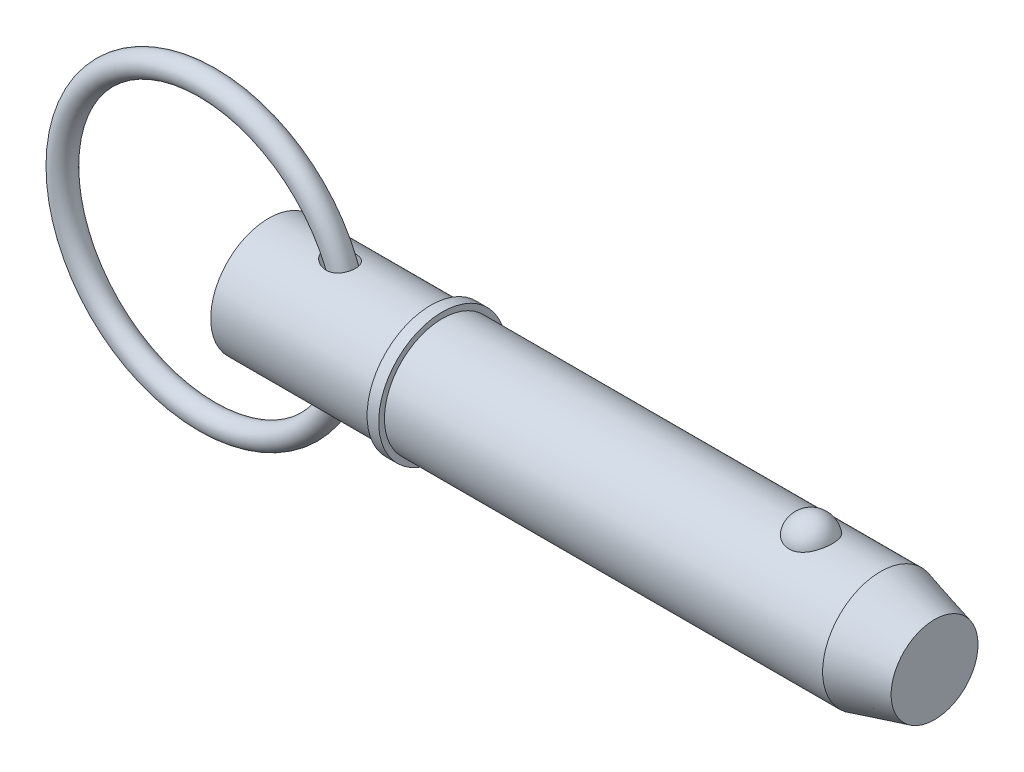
ISO-10303-21;
HEADER;
FILE_DESCRIPTION(('STEP AP214'),'2;1');
FILE_NAME('part.step','',(''),(''),'','','');
FILE_SCHEMA(('AUTOMOTIVE_DESIGN { 1 0 10303 214 1 1 1 1 }'));
ENDSEC;
DATA;
#1=APPLICATION_CONTEXT('core data for automotive mechanical design processes');
#2=APPLICATION_PROTOCOL_DEFINITION('international standard','automotive_design',2000,#1);
#3=PRODUCT_CONTEXT('',#1,'mechanical');
#4=PRODUCT('Part','Part','',(#3));
#5=PRODUCT_RELATED_PRODUCT_CATEGORY('part','',(#4));
#6=PRODUCT_DEFINITION_FORMATION('','',#4);
#7=PRODUCT_DEFINITION_CONTEXT('part definition',#1,'design');
#8=PRODUCT_DEFINITION('design','',#6,#7);
#9=PRODUCT_DEFINITION_SHAPE('','',#8);
#10=(LENGTH_UNIT() NAMED_UNIT(*) SI_UNIT(.MILLI.,.METRE.));
#11=(NAMED_UNIT(*) PLANE_ANGLE_UNIT() SI_UNIT($,.RADIAN.));
#12=(NAMED_UNIT(*) SI_UNIT($,.STERADIAN.) SOLID_ANGLE_UNIT());
#13=UNCERTAINTY_MEASURE_WITH_UNIT(LENGTH_MEASURE(1.E-05),#10,'distance_accuracy_value','');
#14=(GEOMETRIC_REPRESENTATION_CONTEXT(3) GLOBAL_UNCERTAINTY_ASSIGNED_CONTEXT((#13)) GLOBAL_UNIT_ASSIGNED_CONTEXT((#10,
#11,#12)) REPRESENTATION_CONTEXT('',''));
#15=CARTESIAN_POINT('',(0.,0.,0.));
#16=DIRECTION('',(0.,0.,1.));
#17=DIRECTION('',(1.,0.,0.));
#18=AXIS2_PLACEMENT_3D('',#15,#16,#17);
#19=CARTESIAN_POINT('',(-13.4840686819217,0.,0.));
#20=DIRECTION('',(0.,0.,1.));
#21=DIRECTION('',(1.,0.,0.));
#22=AXIS2_PLACEMENT_3D('',#19,#20,#21);
#23=TOROIDAL_SURFACE('',#22,31.75,2.54);
#24=CARTESIAN_POINT('',(20.8059313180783,0.,0.));
#25=VERTEX_POINT('',#24);
#26=VERTEX_LOOP('',#25);
#27=FACE_BOUND('',#26,.T.);
#28=ADVANCED_FACE('P0_F12',(#27),#23,.T.);
#29=CLOSED_SHELL('',(#28));
#30=MANIFOLD_SOLID_BREP('P0_B1',#29);
#31=CARTESIAN_POINT('',(0.,0.,0.));
#32=DIRECTION('',(1.,0.,0.));
#33=DIRECTION('',(0.,0.,-1.));
#34=AXIS2_PLACEMENT_3D('',#31,#32,#33);
#35=CYLINDRICAL_SURFACE('',#34,12.7);
#36=CARTESIAN_POINT('',(13.092900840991,12.5230976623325,-2.11234992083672));
#37=CARTESIAN_POINT('',(13.2535855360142,12.4976398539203,-2.26328363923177));
#38=CARTESIAN_POINT('',(13.4280602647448,12.4718592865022,-2.39955782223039));
#39=CARTESIAN_POINT('',(13.7976341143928,12.4229301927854,-2.64122157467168));
#40=CARTESIAN_POINT('',(13.9927568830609,12.3997847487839,-2.7465751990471));
#41=CARTESIAN_POINT('',(14.397672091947,12.3590534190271,-2.92439761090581));
#42=CARTESIAN_POINT('',(14.6074445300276,12.3414601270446,-2.99691026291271));
#43=CARTESIAN_POINT('',(15.0366557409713,12.3142893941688,-3.10669649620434));
#44=CARTESIAN_POINT('',(15.2560902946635,12.3047084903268,-3.14398530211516));
#45=CARTESIAN_POINT('',(15.5877843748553,12.2976819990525,-3.17128282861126));
#46=CARTESIAN_POINT('',(15.6989364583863,12.2965677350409,-3.17559470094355));
#47=CARTESIAN_POINT('',(15.9211629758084,12.2969101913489,-3.17427486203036));
#48=CARTESIAN_POINT('',(16.0322374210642,12.2983656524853,-3.16864802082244));
#49=CARTESIAN_POINT('',(16.2532861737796,12.3038832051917,-3.14715368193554));
#50=CARTESIAN_POINT('',(16.363260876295,12.3079443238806,-3.13129000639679));
#51=CARTESIAN_POINT('',(16.5810669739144,12.3185954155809,-3.08912320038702));
#52=CARTESIAN_POINT('',(16.6888986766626,12.3251850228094,-3.06282157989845));
#53=CARTESIAN_POINT('',(16.8894247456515,12.3398294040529,-3.00323791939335));
#54=CARTESIAN_POINT('',(16.9824664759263,12.3476389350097,-2.97106098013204));
#55=CARTESIAN_POINT('',(17.1651267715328,12.3648759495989,-2.89848824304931));
#56=CARTESIAN_POINT('',(17.2547457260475,12.3743032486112,-2.85809338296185));
#57=CARTESIAN_POINT('',(17.4297224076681,12.3944822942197,-2.76927391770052));
#58=CARTESIAN_POINT('',(17.5150817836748,12.40523352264,-2.72085245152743));
#59=CARTESIAN_POINT('',(17.6807665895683,12.4277046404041,-2.61629867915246));
#60=CARTESIAN_POINT('',(17.7610923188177,12.4394244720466,-2.56016683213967));
#61=CARTESIAN_POINT('',(17.9797287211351,12.4733252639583,-2.39133767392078));
#62=CARTESIAN_POINT('',(18.1114611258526,12.4961902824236,-2.27005507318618));
#63=CARTESIAN_POINT('',(18.3518677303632,12.5412050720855,-2.00648954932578));
#64=CARTESIAN_POINT('',(18.4605454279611,12.5633549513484,-1.86420981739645));
#65=CARTESIAN_POINT('',(18.6498843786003,12.6039384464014,-1.5661481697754));
#66=CARTESIAN_POINT('',(18.7311185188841,12.622444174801,-1.41073996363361));
#67=CARTESIAN_POINT('',(18.8669149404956,12.6543302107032,-1.08819514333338));
#68=CARTESIAN_POINT('',(18.921477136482,12.6677105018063,-0.921058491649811));
#69=CARTESIAN_POINT('',(19.0028875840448,12.6879542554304,-0.57902988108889));
#70=CARTESIAN_POINT('',(19.0296164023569,12.6947896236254,-0.40410783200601));
#71=CARTESIAN_POINT('',(19.0543673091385,12.7011128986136,-0.0521104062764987));
#72=CARTESIAN_POINT('',(19.0523885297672,12.7006005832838,0.124965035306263));
#73=CARTESIAN_POINT('',(19.019700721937,12.692266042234,0.476969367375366));
#74=CARTESIAN_POINT('',(18.9888798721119,12.6844153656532,0.651887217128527));
#75=CARTESIAN_POINT('',(18.8990221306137,12.6622099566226,0.99389064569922));
#76=CARTESIAN_POINT('',(18.839985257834,12.6478552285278,1.16097622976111));
#77=CARTESIAN_POINT('',(18.6951419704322,12.6142309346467,1.48231767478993));
#78=CARTESIAN_POINT('',(18.6093706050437,12.5949678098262,1.63659000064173));
#79=CARTESIAN_POINT('',(18.4131352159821,12.5536490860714,1.92810749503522));
#80=CARTESIAN_POINT('',(18.3026732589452,12.5315937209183,2.06535408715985));
#81=CARTESIAN_POINT('',(18.060669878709,12.4872833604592,2.31822774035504));
#82=CARTESIAN_POINT('',(17.9292520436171,12.4650302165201,2.43397343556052));
#83=CARTESIAN_POINT('',(17.6485957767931,12.4226514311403,2.64178289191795));
#84=CARTESIAN_POINT('',(17.4993587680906,12.4025256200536,2.73384854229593));
#85=CARTESIAN_POINT('',(17.1869531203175,12.3664726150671,2.8925825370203));
#86=CARTESIAN_POINT('',(17.0237450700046,12.3505578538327,2.95917592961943));
#87=CARTESIAN_POINT('',(16.6884731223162,12.3245177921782,3.06582547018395));
#88=CARTESIAN_POINT('',(16.516407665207,12.3143935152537,3.10587692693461));
#89=CARTESIAN_POINT('',(16.1604213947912,12.3003788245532,3.16093927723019));
#90=CARTESIAN_POINT('',(15.9763106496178,12.2967791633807,3.17478342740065));
#91=CARTESIAN_POINT('',(15.6080973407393,12.2966663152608,3.1752118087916));
#92=CARTESIAN_POINT('',(15.4239948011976,12.3001555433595,3.16178674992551));
#93=CARTESIAN_POINT('',(15.0417156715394,12.3141744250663,3.10676725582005));
#94=CARTESIAN_POINT('',(14.8439465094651,12.3253658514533,3.06251977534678));
#95=CARTESIAN_POINT('',(14.4574652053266,12.3538942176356,2.94531863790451));
#96=CARTESIAN_POINT('',(14.2687614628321,12.3712367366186,2.87233891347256));
#97=CARTESIAN_POINT('',(13.8856104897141,12.4121323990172,2.69045747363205));
#98=CARTESIAN_POINT('',(13.6926012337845,12.4361434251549,2.57861276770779));
#99=CARTESIAN_POINT('',(13.328588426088,12.4862632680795,2.32379935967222));
#100=CARTESIAN_POINT('',(13.1575718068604,12.5123708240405,2.18084927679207));
#101=CARTESIAN_POINT('',(12.8776146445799,12.5579467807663,1.89840233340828));
#102=CARTESIAN_POINT('',(12.7631663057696,12.5776642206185,1.76440341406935));
#103=CARTESIAN_POINT('',(12.5574911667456,12.6143643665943,1.47931295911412));
#104=CARTESIAN_POINT('',(12.4662309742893,12.6313509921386,1.32824646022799));
#105=CARTESIAN_POINT('',(12.3240650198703,12.6583901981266,1.03598403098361));
#106=CARTESIAN_POINT('',(12.2691183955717,12.6691064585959,0.89682285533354));
#107=CARTESIAN_POINT('',(12.1828741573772,12.6860954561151,0.611068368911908));
#108=CARTESIAN_POINT('',(12.1515620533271,12.6923709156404,0.464479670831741));
#109=CARTESIAN_POINT('',(12.1147168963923,12.6997676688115,0.167420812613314));
#110=CARTESIAN_POINT('',(12.109270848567,12.7008715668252,0.0169392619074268));
#111=CARTESIAN_POINT('',(12.1248234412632,12.6977391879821,-0.282592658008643));
#112=CARTESIAN_POINT('',(12.1458245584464,12.6935024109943,-0.431642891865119));
#113=CARTESIAN_POINT('',(12.210908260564,12.6805581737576,-0.716008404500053));
#114=CARTESIAN_POINT('',(12.2537133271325,12.6720986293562,-0.851633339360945));
#115=CARTESIAN_POINT('',(12.3591295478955,12.6516826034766,-1.11460776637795));
#116=CARTESIAN_POINT('',(12.4217455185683,12.6397252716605,-1.24195523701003));
#117=CARTESIAN_POINT('',(12.5735635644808,12.61152213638,-1.50300095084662));
#118=CARTESIAN_POINT('',(12.6652159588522,12.5949150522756,-1.63522875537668));
#119=CARTESIAN_POINT('',(12.8664347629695,12.5599626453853,-1.88501670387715));
#120=CARTESIAN_POINT('',(12.9760196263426,12.541615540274,-2.00256151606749));
#121=CARTESIAN_POINT('',(13.092900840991,12.5230976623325,-2.11234992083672));
#122=B_SPLINE_CURVE_WITH_KNOTS('',3,(#36,#37,#38,#39,#40,#41,#42,#43,#44,#45,#46,#47,#48,#49,
#50,#51,#52,#53,#54,#55,#56,#57,#58,#59,#60,#61,#62,#63,#64,#65,#66,#67,#68,#69,#70,#71,#72,#73,
#74,#75,#76,#77,#78,#79,#80,#81,#82,#83,#84,#85,#86,#87,#88,#89,#90,#91,#92,#93,#94,#95,#96,#97,
#98,#99,#100,#101,#102,#103,#104,#105,#106,#107,#108,#109,#110,#111,#112,#113,#114,#115,#116,
#117,#118,#119,#120,#121),.UNSPECIFIED.,.T.,.F.,(4,2,2,2,2,2,2,2,2,2,2,2,2,2,2,2,2,2,2,2,2,2,2,
2,2,2,2,2,2,2,2,2,2,2,2,2,2,2,2,2,2,2,4),(0.,0.665132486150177,1.33103515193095,
1.99604575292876,2.66076878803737,2.99410229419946,3.32727250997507,3.66031840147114,
3.99331613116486,4.28918991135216,4.58502994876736,4.88075456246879,5.17646157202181,
5.71510826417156,6.25367317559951,6.78017774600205,7.30668400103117,7.83544030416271,
8.36421259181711,8.89504347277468,9.42587399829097,9.95601150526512,10.4861046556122,
11.0131799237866,11.54021312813,12.0687854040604,12.597451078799,13.1491450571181,
13.7010270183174,14.3074556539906,14.914435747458,15.5844380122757,16.2540403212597,
16.7839879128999,17.3131679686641,17.7612578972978,18.2090728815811,18.658393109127,
19.1077554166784,19.5333866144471,19.959121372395,20.4424347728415,20.9262486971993),.UNSPECIFIED.);
#123=CARTESIAN_POINT('',(13.092900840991,12.5230976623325,-2.11234992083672));
#124=VERTEX_POINT('',#123);
#125=EDGE_CURVE('P1_E42',#124,#124,#122,.T.);
#126=ORIENTED_EDGE('',*,*,#125,.T.);
#127=EDGE_LOOP('',(#126));
#128=FACE_BOUND('',#127,.T.);
#129=CARTESIAN_POINT('',(0.,0.,0.));
#130=DIRECTION('',(1.,0.,0.));
#131=DIRECTION('',(0.,0.,-1.));
#132=AXIS2_PLACEMENT_3D('',#129,#130,#131);
#133=CIRCLE('',#132,12.7);
#134=CARTESIAN_POINT('',(0.,0.,-12.7));
#135=VERTEX_POINT('',#134);
#136=EDGE_CURVE('P1_E9',#135,#135,#133,.T.);
#137=ORIENTED_EDGE('',*,*,#136,.T.);
#138=EDGE_LOOP('',(#137));
#139=FACE_BOUND('',#138,.T.);
#140=CARTESIAN_POINT('',(35.56,0.,0.));
#141=DIRECTION('',(1.,0.,0.));
#142=DIRECTION('',(0.,0.,-1.));
#143=AXIS2_PLACEMENT_3D('',#140,#141,#142);
#144=CIRCLE('',#143,12.7);
#145=CARTESIAN_POINT('',(35.56,0.,-12.7));
#146=VERTEX_POINT('',#145);
#147=EDGE_CURVE('P1_E25',#146,#146,#144,.T.);
#148=ORIENTED_EDGE('',*,*,#147,.F.);
#149=EDGE_LOOP('',(#148));
#150=FACE_BOUND('',#149,.T.);
#151=CARTESIAN_POINT('',(13.092900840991,-12.5230976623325,-2.11234992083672));
#152=CARTESIAN_POINT('',(12.9659872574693,-12.5432050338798,-1.99314161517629));
#153=CARTESIAN_POINT('',(12.847667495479,-12.5631124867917,-1.86478966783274));
#154=CARTESIAN_POINT('',(12.6324721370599,-12.6007427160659,-1.59069749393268));
#155=CARTESIAN_POINT('',(12.5355833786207,-12.6184668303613,-1.444968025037));
#156=CARTESIAN_POINT('',(12.4099071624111,-12.642034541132,-1.21450950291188));
#157=CARTESIAN_POINT('',(12.3711427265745,-12.6494175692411,-1.13527163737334));
#158=CARTESIAN_POINT('',(12.3010994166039,-12.6628962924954,-0.973464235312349));
#159=CARTESIAN_POINT('',(12.2698164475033,-12.6689926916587,-0.890896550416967));
#160=CARTESIAN_POINT('',(12.2153933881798,-12.6796767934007,-0.72309085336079));
#161=CARTESIAN_POINT('',(12.192246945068,-12.6842656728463,-0.637854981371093));
#162=CARTESIAN_POINT('',(12.154603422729,-12.6917620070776,-0.465421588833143));
#163=CARTESIAN_POINT('',(12.1401047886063,-12.69466976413,-0.378224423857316));
#164=CARTESIAN_POINT('',(12.1214471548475,-12.6984180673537,-0.214417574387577));
#165=CARTESIAN_POINT('',(12.1161713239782,-12.699481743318,-0.13793855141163));
#166=CARTESIAN_POINT('',(12.1124989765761,-12.7002217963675,0.0152189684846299));
#167=CARTESIAN_POINT('',(12.1141046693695,-12.6998977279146,0.0918975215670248));
#168=CARTESIAN_POINT('',(12.1241695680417,-12.6978712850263,0.244746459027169));
#169=CARTESIAN_POINT('',(12.132625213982,-12.6961696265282,0.320917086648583));
#170=CARTESIAN_POINT('',(12.1562110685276,-12.6914452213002,0.472185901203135));
#171=CARTESIAN_POINT('',(12.1713438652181,-12.6884219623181,0.547283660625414));
#172=CARTESIAN_POINT('',(12.223731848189,-12.6780227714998,0.759415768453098));
#173=CARTESIAN_POINT('',(12.268839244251,-12.6691353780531,0.894507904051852));
#174=CARTESIAN_POINT('',(12.3786059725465,-12.6479567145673,1.1560647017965));
#175=CARTESIAN_POINT('',(12.4432700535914,-12.6356646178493,1.28252725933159));
#176=CARTESIAN_POINT('',(12.5971341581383,-12.607236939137,1.5381272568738));
#177=CARTESIAN_POINT('',(12.6882234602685,-12.5908303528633,1.66609325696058));
#178=CARTESIAN_POINT('',(12.887209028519,-12.5564642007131,1.90792082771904));
#179=CARTESIAN_POINT('',(12.995115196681,-12.5385037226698,2.02177401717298));
#180=CARTESIAN_POINT('',(13.2471335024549,-12.4987806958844,2.25547266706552));
#181=CARTESIAN_POINT('',(13.3941979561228,-12.4769622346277,2.3721269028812));
#182=CARTESIAN_POINT('',(13.7036983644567,-12.4349587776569,2.58329351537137));
#183=CARTESIAN_POINT('',(13.8661464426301,-12.4147750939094,2.67778822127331));
#184=CARTESIAN_POINT('',(14.2306024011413,-12.3748157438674,2.85722657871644));
#185=CARTESIAN_POINT('',(14.4347220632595,-12.3556533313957,2.93804226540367));
#186=CARTESIAN_POINT('',(14.8540416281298,-12.3245430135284,3.06594877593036));
#187=CARTESIAN_POINT('',(15.0692453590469,-12.3125976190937,3.11302786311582));
#188=CARTESIAN_POINT('',(15.3981213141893,-12.3014943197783,3.15648626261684));
#189=CARTESIAN_POINT('',(15.5100235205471,-12.298940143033,3.16639841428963));
#190=CARTESIAN_POINT('',(15.7342812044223,-12.2963942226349,3.17627668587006));
#191=CARTESIAN_POINT('',(15.8466364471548,-12.2964012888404,3.17624742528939));
#192=CARTESIAN_POINT('',(16.0707903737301,-12.2990694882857,3.16589868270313));
#193=CARTESIAN_POINT('',(16.1825892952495,-12.3017293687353,3.1555840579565));
#194=CARTESIAN_POINT('',(16.4046123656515,-12.3096862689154,3.12440163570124));
#195=CARTESIAN_POINT('',(16.514836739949,-12.314982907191,3.10353536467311));
#196=CARTESIAN_POINT('',(16.7211934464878,-12.3273933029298,3.05384263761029));
#197=CARTESIAN_POINT('',(16.8175961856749,-12.3342598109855,3.0260738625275));
#198=CARTESIAN_POINT('',(17.0073515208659,-12.3498131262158,2.96195947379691));
#199=CARTESIAN_POINT('',(17.100704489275,-12.3584997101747,2.92561491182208));
#200=CARTESIAN_POINT('',(17.2834584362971,-12.3774243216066,2.84448580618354));
#201=CARTESIAN_POINT('',(17.3728610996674,-12.3876616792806,2.79970490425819));
#202=CARTESIAN_POINT('',(17.5469061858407,-12.409352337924,2.701939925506));
#203=CARTESIAN_POINT('',(17.6315489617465,-12.4208055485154,2.64895645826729));
#204=CARTESIAN_POINT('',(17.7872886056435,-12.4433734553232,2.54070972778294));
#205=CARTESIAN_POINT('',(17.8589017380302,-12.4544123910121,2.4861716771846));
#206=CARTESIAN_POINT('',(17.9970802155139,-12.4768404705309,2.37105291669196));
#207=CARTESIAN_POINT('',(18.063643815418,-12.4882297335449,2.31047013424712));
#208=CARTESIAN_POINT('',(18.1911677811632,-12.5110137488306,2.18372894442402));
#209=CARTESIAN_POINT('',(18.2521311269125,-12.5224084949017,2.11757353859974));
#210=CARTESIAN_POINT('',(18.3680676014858,-12.5448751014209,1.98014449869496));
#211=CARTESIAN_POINT('',(18.4230385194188,-12.5559468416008,1.90886899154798));
#212=CARTESIAN_POINT('',(18.5752306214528,-12.5875288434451,1.6925769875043));
#213=CARTESIAN_POINT('',(18.6637018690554,-12.6071482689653,1.54111740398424));
#214=CARTESIAN_POINT('',(18.8143485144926,-12.6417556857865,1.225260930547));
#215=CARTESIAN_POINT('',(18.876524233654,-12.6567437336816,1.06086419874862));
#216=CARTESIAN_POINT('',(18.9733884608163,-12.6805238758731,0.723195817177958));
#217=CARTESIAN_POINT('',(19.0079967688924,-12.6892978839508,0.549899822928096));
#218=CARTESIAN_POINT('',(19.0486500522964,-12.6996362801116,0.199781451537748));
#219=CARTESIAN_POINT('',(19.054694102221,-12.7012004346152,0.0229589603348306));
#220=CARTESIAN_POINT('',(19.0380549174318,-12.6969431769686,-0.330044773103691));
#221=CARTESIAN_POINT('',(19.0152419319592,-12.6910884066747,-0.506219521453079));
#222=CARTESIAN_POINT('',(18.9411599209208,-12.672565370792,-0.852112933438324));
#223=CARTESIAN_POINT('',(18.8898907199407,-12.659897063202,-1.0218315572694));
#224=CARTESIAN_POINT('',(18.7600888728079,-12.6291327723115,-1.34987035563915));
#225=CARTESIAN_POINT('',(18.6815715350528,-12.6110398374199,-1.50819687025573));
#226=CARTESIAN_POINT('',(18.4991526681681,-12.5714188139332,-1.808997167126));
#227=CARTESIAN_POINT('',(18.3952529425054,-12.5498909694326,-1.95147207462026));
#228=CARTESIAN_POINT('',(18.1653806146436,-12.5059234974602,-2.21580059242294));
#229=CARTESIAN_POINT('',(18.0395297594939,-12.4834893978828,-2.33776101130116));
#230=CARTESIAN_POINT('',(17.7688701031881,-12.4400863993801,-2.55870399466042));
#231=CARTESIAN_POINT('',(17.624063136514,-12.4191173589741,-2.65768878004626));
#232=CARTESIAN_POINT('',(17.3196803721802,-12.380896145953,-2.8304192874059));
#233=CARTESIAN_POINT('',(17.1601036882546,-12.3636441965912,-2.90416349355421));
#234=CARTESIAN_POINT('',(16.8308162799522,-12.3345597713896,-3.02531546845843));
#235=CARTESIAN_POINT('',(16.6611041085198,-12.322728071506,-3.07271946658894));
#236=CARTESIAN_POINT('',(16.3099674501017,-12.3051318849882,-3.14246490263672));
#237=CARTESIAN_POINT('',(16.1283412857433,-12.2996014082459,-3.16384159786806));
#238=CARTESIAN_POINT('',(15.7639014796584,-12.2955807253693,-3.17942379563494));
#239=CARTESIAN_POINT('',(15.5810875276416,-12.2970924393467,-3.17362188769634));
#240=CARTESIAN_POINT('',(15.20154276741,-12.307074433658,-3.13470416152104));
#241=CARTESIAN_POINT('',(15.0050835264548,-12.316173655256,-3.09911848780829));
#242=CARTESIAN_POINT('',(14.6197996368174,-12.3407987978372,-2.99954607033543));
#243=CARTESIAN_POINT('',(14.4309834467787,-12.3563316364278,-2.93552875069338));
#244=CARTESIAN_POINT('',(14.0353751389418,-12.3949378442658,-2.76840280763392));
#245=CARTESIAN_POINT('',(13.8306109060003,-12.4188242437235,-2.66064798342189));
#246=CARTESIAN_POINT('',(13.4432099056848,-12.4696241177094,-2.4113475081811));
#247=CARTESIAN_POINT('',(13.2605568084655,-12.4965353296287,-2.26982702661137));
#248=CARTESIAN_POINT('',(13.092900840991,-12.5230976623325,-2.11234992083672));
#249=B_SPLINE_CURVE_WITH_KNOTS('',3,(#151,#152,#153,#154,#155,#156,#157,#158,#159,#160,#161,
#162,#163,#164,#165,#166,#167,#168,#169,#170,#171,#172,#173,#174,#175,#176,#177,#178,#179,#180,
#181,#182,#183,#184,#185,#186,#187,#188,#189,#190,#191,#192,#193,#194,#195,#196,#197,#198,#199,
#200,#201,#202,#203,#204,#205,#206,#207,#208,#209,#210,#211,#212,#213,#214,#215,#216,#217,#218,
#219,#220,#221,#222,#223,#224,#225,#226,#227,#228,#229,#230,#231,#232,#233,#234,#235,#236,#237,
#238,#239,#240,#241,#242,#243,#244,#245,#246,#247,#248),.UNSPECIFIED.,.T.,.F.,(4,2,2,2,2,2,2,2,
2,2,2,2,2,2,2,2,2,2,2,2,2,2,2,2,2,2,2,2,2,2,2,2,2,2,2,2,2,2,2,2,2,2,2,2,2,2,2,2,4),(0.,
0.525289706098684,1.05025590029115,1.31549608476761,1.58059075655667,1.84547798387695,
2.11031756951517,2.34000998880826,2.56977615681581,2.79942299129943,3.0291589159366,
3.45531787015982,3.8815803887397,4.35362362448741,4.82594586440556,5.39074449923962,
5.95599200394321,6.61421946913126,7.27267581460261,7.60939383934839,7.94595540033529,
8.2823580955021,8.61871213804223,8.91997243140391,9.22119579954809,9.52228943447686,
9.82336070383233,10.0950952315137,10.3669232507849,10.6386057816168,10.9103882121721,
11.4371688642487,11.9639430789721,12.4922442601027,13.0205625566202,13.5512648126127,
14.0819703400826,14.6123781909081,15.1427483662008,15.6702654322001,16.1977314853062,
16.7252292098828,17.2528024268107,17.7993878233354,18.3461222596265,18.9432829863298,
19.5410874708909,20.2355241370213,20.9294447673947),.UNSPECIFIED.);
#250=CARTESIAN_POINT('',(13.092900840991,-12.5230976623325,-2.11234992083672));
#251=VERTEX_POINT('',#250);
#252=EDGE_CURVE('P1_E17',#251,#251,#249,.T.);
#253=ORIENTED_EDGE('',*,*,#252,.T.);
#254=EDGE_LOOP('',(#253));
#255=FACE_BOUND('',#254,.T.);
#256=ADVANCED_FACE('P1_F13',(#128,#139,#150,#255),#35,.T.);
#257=CARTESIAN_POINT('',(0.,0.,0.));
#258=DIRECTION('',(1.,0.,0.));
#259=DIRECTION('',(0.,0.,-1.));
#260=AXIS2_PLACEMENT_3D('',#257,#258,#259);
#261=CYLINDRICAL_SURFACE('',#260,12.7);
#262=CARTESIAN_POINT('',(134.200738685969,0.,0.));
#263=DIRECTION('',(1.,0.,0.));
#264=DIRECTION('',(0.,0.,-1.));
#265=AXIS2_PLACEMENT_3D('',#262,#263,#264);
#266=CIRCLE('',#265,12.7);
#267=CARTESIAN_POINT('',(134.200738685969,0.,-12.7));
#268=VERTEX_POINT('',#267);
#269=EDGE_CURVE('P1_E99',#268,#268,#266,.T.);
#270=ORIENTED_EDGE('',*,*,#269,.F.);
#271=EDGE_LOOP('',(#270));
#272=FACE_BOUND('',#271,.T.);
#273=CARTESIAN_POINT('',(38.1,0.,0.));
#274=DIRECTION('',(1.,0.,0.));
#275=DIRECTION('',(0.,0.,-1.));
#276=AXIS2_PLACEMENT_3D('',#273,#274,#275);
#277=CIRCLE('',#276,12.7);
#278=CARTESIAN_POINT('',(38.1,0.,-12.7));
#279=VERTEX_POINT('',#278);
#280=EDGE_CURVE('P1_E96',#279,#279,#277,.T.);
#281=ORIENTED_EDGE('',*,*,#280,.T.);
#282=EDGE_LOOP('',(#281));
#283=FACE_BOUND('',#282,.T.);
#284=CARTESIAN_POINT('',(118.960042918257,11.7500437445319,4.8193850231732));
#285=CARTESIAN_POINT('',(118.835088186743,11.7500430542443,4.81938571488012));
#286=CARTESIAN_POINT('',(118.710144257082,11.7520975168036,4.81438658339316));
#287=CARTESIAN_POINT('',(118.461142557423,11.760253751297,4.79442904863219));
#288=CARTESIAN_POINT('',(118.337085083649,11.7663568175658,4.77946746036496));
#289=CARTESIAN_POINT('',(118.090901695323,11.7824262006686,4.73971414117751));
#290=CARTESIAN_POINT('',(117.968774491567,11.7923898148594,4.71492928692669));
#291=CARTESIAN_POINT('',(117.727187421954,11.8158938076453,4.65571340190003));
#292=CARTESIAN_POINT('',(117.60772859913,11.8294355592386,4.62127866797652));
#293=CARTESIAN_POINT('',(117.372557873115,11.8596812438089,4.54309502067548));
#294=CARTESIAN_POINT('',(117.256839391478,11.8763792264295,4.4993636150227));
#295=CARTESIAN_POINT('',(117.029653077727,11.9124878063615,4.40287235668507));
#296=CARTESIAN_POINT('',(116.918186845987,11.9318994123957,4.35010914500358));
#297=CARTESIAN_POINT('',(116.591278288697,11.9934256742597,4.17881316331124));
#298=CARTESIAN_POINT('',(116.383127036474,12.038858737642,4.04720756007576));
#299=CARTESIAN_POINT('',(115.985850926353,12.1352173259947,3.74856446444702));
#300=CARTESIAN_POINT('',(115.797443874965,12.1862630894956,3.58061821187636));
#301=CARTESIAN_POINT('',(115.450521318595,12.2875163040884,3.21600758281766));
#302=CARTESIAN_POINT('',(115.292011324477,12.3377235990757,3.01933792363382));
#303=CARTESIAN_POINT('',(115.00168878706,12.434492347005,2.59291655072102));
#304=CARTESIAN_POINT('',(114.871376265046,12.4807925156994,2.36208286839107));
#305=CARTESIAN_POINT('',(114.649407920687,12.5623454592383,1.88070399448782));
#306=CARTESIAN_POINT('',(114.557755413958,12.5975972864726,1.63015711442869));
#307=CARTESIAN_POINT('',(114.414046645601,12.6538414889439,1.11298869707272));
#308=CARTESIAN_POINT('',(114.362499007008,12.6746503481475,0.846205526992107));
#309=CARTESIAN_POINT('',(114.301977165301,12.699153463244,0.307085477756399));
#310=CARTESIAN_POINT('',(114.293001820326,12.7028481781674,0.03474874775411));
#311=CARTESIAN_POINT('',(114.317731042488,12.6927785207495,-0.506073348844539));
#312=CARTESIAN_POINT('',(114.351189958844,12.6791146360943,-0.774571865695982));
#313=CARTESIAN_POINT('',(114.459687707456,12.635882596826,-1.3017024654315));
#314=CARTESIAN_POINT('',(114.53472729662,12.6063141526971,-1.56033436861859));
#315=CARTESIAN_POINT('',(114.72500006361,12.5342328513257,-2.06083899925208));
#316=CARTESIAN_POINT('',(114.840287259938,12.4917026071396,-2.3026886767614));
#317=CARTESIAN_POINT('',(115.108704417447,12.3981123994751,-2.76259600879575));
#318=CARTESIAN_POINT('',(115.261837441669,12.3470517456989,-2.98065173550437));
#319=CARTESIAN_POINT('',(115.603507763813,12.2416045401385,-3.38786328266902));
#320=CARTESIAN_POINT('',(115.792201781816,12.1872040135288,-3.57688418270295));
#321=CARTESIAN_POINT('',(116.200239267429,12.0814086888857,-3.91941073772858));
#322=CARTESIAN_POINT('',(116.419580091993,12.0300136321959,-4.07291945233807));
#323=CARTESIAN_POINT('',(116.878375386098,11.9373542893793,-4.33691289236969));
#324=CARTESIAN_POINT('',(117.117304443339,11.8958982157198,-4.44824125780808));
#325=CARTESIAN_POINT('',(117.61243761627,11.8268116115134,-4.62881985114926));
#326=CARTESIAN_POINT('',(117.868635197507,11.7991758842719,-4.69808589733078));
#327=CARTESIAN_POINT('',(118.377164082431,11.7622209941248,-4.78983181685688));
#328=CARTESIAN_POINT('',(118.629041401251,11.7520502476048,-4.81449025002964));
#329=CARTESIAN_POINT('',(119.133573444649,11.7485796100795,-4.82295735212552));
#330=CARTESIAN_POINT('',(119.386228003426,11.7552763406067,-4.80677420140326));
#331=CARTESIAN_POINT('',(119.876834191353,11.7842584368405,-4.73525430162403));
#332=CARTESIAN_POINT('',(120.114998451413,11.8060486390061,-4.68116061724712));
#333=CARTESIAN_POINT('',(120.578489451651,11.8622750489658,-4.53678133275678));
#334=CARTESIAN_POINT('',(120.803815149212,11.8967122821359,-4.44649279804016));
#335=CARTESIAN_POINT('',(121.240801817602,11.9754603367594,-4.22987613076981));
#336=CARTESIAN_POINT('',(121.452057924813,12.0199699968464,-4.10280539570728));
#337=CARTESIAN_POINT('',(121.850601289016,12.1138028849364,-3.81685409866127));
#338=CARTESIAN_POINT('',(122.037883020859,12.163127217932,-3.65796622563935));
#339=CARTESIAN_POINT('',(122.393350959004,12.2642343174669,-3.30364864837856));
#340=CARTESIAN_POINT('',(122.560111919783,12.3160165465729,-3.10678783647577));
#341=CARTESIAN_POINT('',(122.859579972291,12.4142566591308,-2.68748409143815));
#342=CARTESIAN_POINT('',(122.992280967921,12.4607135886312,-2.46503658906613));
#343=CARTESIAN_POINT('',(123.224691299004,12.5450236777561,-1.99289519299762));
#344=CARTESIAN_POINT('',(123.323215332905,12.5825557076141,-1.74255918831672));
#345=CARTESIAN_POINT('',(123.479227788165,12.6431720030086,-1.22773734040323));
#346=CARTESIAN_POINT('',(123.536715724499,12.6662560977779,-0.963251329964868));
#347=CARTESIAN_POINT('',(123.609544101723,12.6956486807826,-0.427355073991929));
#348=CARTESIAN_POINT('',(123.624837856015,12.7019385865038,-0.155937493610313));
#349=CARTESIAN_POINT('',(123.612779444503,12.6970201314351,0.385928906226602));
#350=CARTESIAN_POINT('',(123.58542805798,12.6858120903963,0.656377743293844));
#351=CARTESIAN_POINT('',(123.513060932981,12.6568455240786,1.0545401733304));
#352=CARTESIAN_POINT('',(123.483796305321,12.6451962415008,1.18577850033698));
#353=CARTESIAN_POINT('',(123.415022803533,12.6181819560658,1.44513808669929));
#354=CARTESIAN_POINT('',(123.375517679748,12.6028183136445,1.57326046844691));
#355=CARTESIAN_POINT('',(123.286439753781,12.5687547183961,1.82554978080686));
#356=CARTESIAN_POINT('',(123.236862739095,12.5500533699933,1.94971503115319));
#357=CARTESIAN_POINT('',(123.12792115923,12.5098093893,2.1931437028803));
#358=CARTESIAN_POINT('',(123.068560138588,12.4882677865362,2.31240887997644));
#359=CARTESIAN_POINT('',(122.93997128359,12.4427679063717,2.54593031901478));
#360=CARTESIAN_POINT('',(122.870688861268,12.4187964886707,2.66015396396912));
#361=CARTESIAN_POINT('',(122.722903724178,12.3691892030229,2.88202659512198));
#362=CARTESIAN_POINT('',(122.644404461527,12.3435539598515,2.98967802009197));
#363=CARTESIAN_POINT('',(122.478550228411,12.2912955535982,3.19774385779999));
#364=CARTESIAN_POINT('',(122.391191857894,12.2646720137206,3.29815546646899));
#365=CARTESIAN_POINT('',(122.208161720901,12.2111945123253,3.49095035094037));
#366=CARTESIAN_POINT('',(122.112493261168,12.1843406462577,3.58333679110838));
#367=CARTESIAN_POINT('',(121.913627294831,12.1312249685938,3.75922876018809));
#368=CARTESIAN_POINT('',(121.810450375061,12.104961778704,3.84275713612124));
#369=CARTESIAN_POINT('',(121.59701336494,12.0537284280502,4.00056406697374));
#370=CARTESIAN_POINT('',(121.486756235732,12.028757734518,4.07484645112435));
#371=CARTESIAN_POINT('',(121.259755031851,11.9808306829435,4.21367959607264));
#372=CARTESIAN_POINT('',(121.143006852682,11.9578756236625,4.27822410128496));
#373=CARTESIAN_POINT('',(120.90394258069,11.9147184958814,4.39698483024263));
#374=CARTESIAN_POINT('',(120.781628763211,11.894515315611,4.45120522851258));
#375=CARTESIAN_POINT('',(120.522952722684,11.8561129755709,4.55255353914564));
#376=CARTESIAN_POINT('',(120.386223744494,11.8381764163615,4.59884858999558));
#377=CARTESIAN_POINT('',(120.108608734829,11.8069093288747,4.67853897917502));
#378=CARTESIAN_POINT('',(119.967724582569,11.7935767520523,4.71194005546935));
#379=CARTESIAN_POINT('',(119.68309446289,11.7720277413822,4.76552188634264));
#380=CARTESIAN_POINT('',(119.539348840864,11.7638106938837,4.78570422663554));
#381=CARTESIAN_POINT('',(119.250411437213,11.7528195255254,4.8126343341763));
#382=CARTESIAN_POINT('',(119.105219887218,11.7500445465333,4.81938421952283));
#383=CARTESIAN_POINT('',(118.960042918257,11.7500437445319,4.8193850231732));
#384=B_SPLINE_CURVE_WITH_KNOTS('',3,(#284,#285,#286,#287,#288,#289,#290,#291,#292,#293,#294,
#295,#296,#297,#298,#299,#300,#301,#302,#303,#304,#305,#306,#307,#308,#309,#310,#311,#312,#313,
#314,#315,#316,#317,#318,#319,#320,#321,#322,#323,#324,#325,#326,#327,#328,#329,#330,#331,#332,
#333,#334,#335,#336,#337,#338,#339,#340,#341,#342,#343,#344,#345,#346,#347,#348,#349,#350,#351,
#352,#353,#354,#355,#356,#357,#358,#359,#360,#361,#362,#363,#364,#365,#366,#367,#368,#369,#370,
#371,#372,#373,#374,#375,#376,#377,#378,#379,#380,#381,#382,#383),.UNSPECIFIED.,.T.,.F.,(4,2,2,
2,2,2,2,2,2,2,2,2,2,2,2,2,2,2,2,2,2,2,2,2,2,2,2,2,2,2,2,2,2,2,2,2,2,2,2,2,2,2,2,2,2,2,2,2,2,4),
(0.,0.374729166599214,0.749578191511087,1.12416526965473,1.49889629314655,1.87292776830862,
2.24709865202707,2.99481328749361,3.76399449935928,4.53331735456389,5.33683915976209,
6.14042986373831,6.95405296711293,7.7676542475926,8.57656703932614,9.38549455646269,
10.1955119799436,11.0055949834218,11.8193353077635,12.6330054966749,13.4294141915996,
14.2255231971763,14.9815786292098,15.7374826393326,16.4696948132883,17.2019663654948,
17.9501979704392,18.6986017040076,19.4844704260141,20.2704797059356,21.0815215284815,
21.8925729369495,22.70452139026,23.5164550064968,23.9209608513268,24.3253187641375,
24.7298461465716,25.1342272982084,25.5409255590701,25.947471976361,26.3541750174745,
26.7607169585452,27.166183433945,27.5714814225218,27.9770386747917,28.3824315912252,
28.8181206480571,29.2536155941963,29.6890582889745,30.1244323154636),.UNSPECIFIED.);
#385=CARTESIAN_POINT('',(118.960042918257,11.7500437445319,4.8193850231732));
#386=VERTEX_POINT('',#385);
#387=EDGE_CURVE('P1_E34',#386,#386,#384,.T.);
#388=ORIENTED_EDGE('',*,*,#387,.T.);
#389=EDGE_LOOP('',(#388));
#390=FACE_BOUND('',#389,.T.);
#391=ADVANCED_FACE('P1_F46',(#272,#283,#390),#261,.T.);
#392=CARTESIAN_POINT('',(0.,0.,0.));
#393=DIRECTION('',(-1.,0.,0.));
#394=DIRECTION('',(0.,0.,1.));
#395=AXIS2_PLACEMENT_3D('',#392,#393,#394);
#396=PLANE('',#395);
#397=ORIENTED_EDGE('',*,*,#136,.F.);
#398=EDGE_LOOP('',(#397));
#399=FACE_BOUND('',#398,.T.);
#400=ADVANCED_FACE('P1_F15',(#399),#396,.T.);
#401=CARTESIAN_POINT('',(35.56,12.7,0.));
#402=DIRECTION('',(-1.,0.,0.));
#403=DIRECTION('',(0.,0.,1.));
#404=AXIS2_PLACEMENT_3D('',#401,#402,#403);
#405=PLANE('',#404);
#406=ORIENTED_EDGE('',*,*,#147,.T.);
#407=EDGE_LOOP('',(#406));
#408=FACE_BOUND('',#407,.T.);
#409=CARTESIAN_POINT('',(35.56,0.,0.));
#410=DIRECTION('',(1.,0.,0.));
#411=DIRECTION('',(0.,0.,-1.));
#412=AXIS2_PLACEMENT_3D('',#409,#410,#411);
#413=CIRCLE('',#412,13.97);
#414=CARTESIAN_POINT('',(35.56,0.,-13.97));
#415=VERTEX_POINT('',#414);
#416=EDGE_CURVE('P1_E30',#415,#415,#413,.T.);
#417=ORIENTED_EDGE('',*,*,#416,.F.);
#418=EDGE_LOOP('',(#417));
#419=FACE_BOUND('',#418,.T.);
#420=ADVANCED_FACE('P1_F81',(#408,#419),#405,.T.);
#421=CARTESIAN_POINT('',(0.,0.,0.));
#422=DIRECTION('',(1.,0.,0.));
#423=DIRECTION('',(0.,0.,-1.));
#424=AXIS2_PLACEMENT_3D('',#421,#422,#423);
#425=CYLINDRICAL_SURFACE('',#424,13.97);
#426=ORIENTED_EDGE('',*,*,#416,.T.);
#427=EDGE_LOOP('',(#426));
#428=FACE_BOUND('',#427,.T.);
#429=CARTESIAN_POINT('',(38.1,0.,0.));
#430=DIRECTION('',(1.,0.,0.));
#431=DIRECTION('',(0.,0.,-1.));
#432=AXIS2_PLACEMENT_3D('',#429,#430,#431);
#433=CIRCLE('',#432,13.97);
#434=CARTESIAN_POINT('',(38.1,0.,-13.97));
#435=VERTEX_POINT('',#434);
#436=EDGE_CURVE('P1_E95',#435,#435,#433,.T.);
#437=ORIENTED_EDGE('',*,*,#436,.F.);
#438=EDGE_LOOP('',(#437));
#439=FACE_BOUND('',#438,.T.);
#440=ADVANCED_FACE('P1_F68',(#428,#439),#425,.T.);
#441=CARTESIAN_POINT('',(38.1,13.97,0.));
#442=DIRECTION('',(1.,0.,0.));
#443=DIRECTION('',(0.,0.,-1.));
#444=AXIS2_PLACEMENT_3D('',#441,#442,#443);
#445=PLANE('',#444);
#446=ORIENTED_EDGE('',*,*,#436,.T.);
#447=EDGE_LOOP('',(#446));
#448=FACE_BOUND('',#447,.T.);
#449=ORIENTED_EDGE('',*,*,#280,.F.);
#450=EDGE_LOOP('',(#449));
#451=FACE_BOUND('',#450,.T.);
#452=ADVANCED_FACE('P1_F62',(#448,#451),#445,.T.);
#453=CARTESIAN_POINT('',(146.05,0.,0.));
#454=DIRECTION('',(-1.,0.,0.));
#455=DIRECTION('',(0.,0.,1.));
#456=AXIS2_PLACEMENT_3D('',#453,#454,#455);
#457=CONICAL_SURFACE('',#456,9.52500000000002,0.26179938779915);
#458=ORIENTED_EDGE('',*,*,#269,.T.);
#459=EDGE_LOOP('',(#458));
#460=FACE_BOUND('',#459,.T.);
#461=CARTESIAN_POINT('',(146.05,0.,0.));
#462=DIRECTION('',(1.,0.,0.));
#463=DIRECTION('',(0.,0.,-1.));
#464=AXIS2_PLACEMENT_3D('',#461,#462,#463);
#465=CIRCLE('',#464,9.52500000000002);
#466=CARTESIAN_POINT('',(146.05,0.,-9.52500000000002));
#467=VERTEX_POINT('',#466);
#468=EDGE_CURVE('P1_E41',#467,#467,#465,.T.);
#469=ORIENTED_EDGE('',*,*,#468,.F.);
#470=EDGE_LOOP('',(#469));
#471=FACE_BOUND('',#470,.T.);
#472=ADVANCED_FACE('P1_F59',(#460,#471),#457,.T.);
#473=CARTESIAN_POINT('',(146.05,9.52500000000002,0.));
#474=DIRECTION('',(1.,0.,0.));
#475=DIRECTION('',(0.,0.,-1.));
#476=AXIS2_PLACEMENT_3D('',#473,#474,#475);
#477=PLANE('',#476);
#478=ORIENTED_EDGE('',*,*,#468,.T.);
#479=EDGE_LOOP('',(#478));
#480=FACE_BOUND('',#479,.T.);
#481=ADVANCED_FACE('P1_F55',(#480),#477,.T.);
#482=CARTESIAN_POINT('',(118.960042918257,11.43,0.));
#483=DIRECTION('',(-1.,0.,0.));
#484=DIRECTION('',(0.,1.,0.));
#485=AXIS2_PLACEMENT_3D('',#482,#483,#484);
#486=SPHERICAL_SURFACE('',#485,4.83000000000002);
#487=ORIENTED_EDGE('',*,*,#387,.F.);
#488=EDGE_LOOP('',(#487));
#489=FACE_BOUND('',#488,.T.);
#490=ADVANCED_FACE('P1_F50',(#489),#486,.T.);
#491=CARTESIAN_POINT('',(-13.4840686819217,0.,0.));
#492=DIRECTION('',(0.,0.,1.));
#493=DIRECTION('',(1.,0.,0.));
#494=AXIS2_PLACEMENT_3D('',#491,#492,#493);
#495=TOROIDAL_SURFACE('',#494,31.75,3.175);
#496=ORIENTED_EDGE('',*,*,#252,.F.);
#497=EDGE_LOOP('',(#496));
#498=FACE_BOUND('',#497,.T.);
#499=ORIENTED_EDGE('',*,*,#125,.F.);
#500=EDGE_LOOP('',(#499));
#501=FACE_BOUND('',#500,.T.);
#502=ADVANCED_FACE('P1_F54',(#498,#501),#495,.F.);
#503=CLOSED_SHELL('',(#256,#391,#400,#420,#440,#452,#472,#481,#490,#502));
#504=MANIFOLD_SOLID_BREP('P1_B1',#503);
#505=ADVANCED_BREP_SHAPE_REPRESENTATION('',(#18,#30,#504),#14);
#506=SHAPE_DEFINITION_REPRESENTATION(#9,#505);
ENDSEC;
END-ISO-10303-21;
